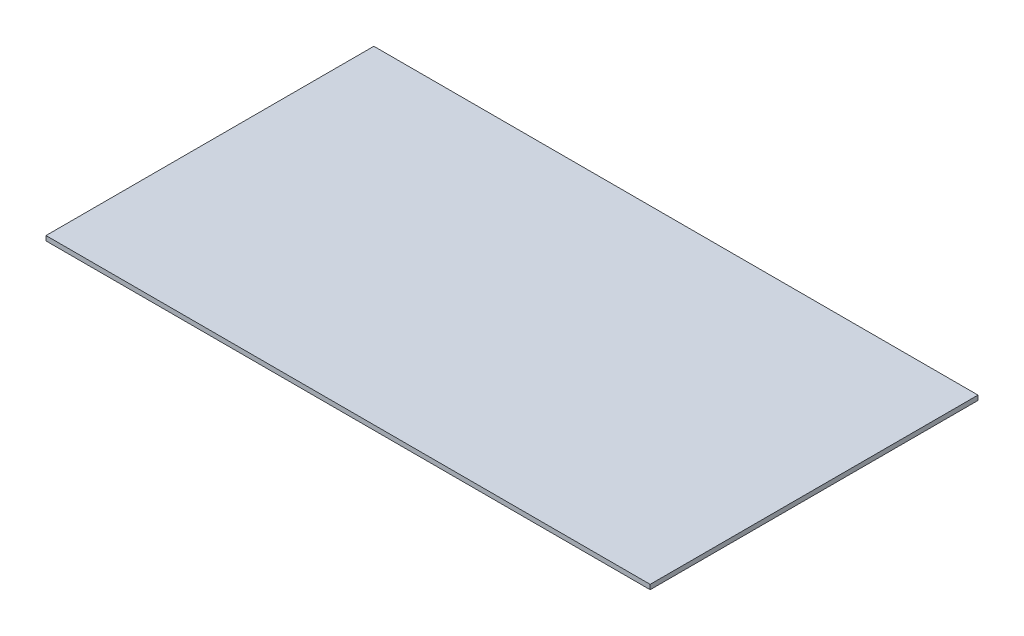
ISO-10303-21;
HEADER;
FILE_DESCRIPTION(('STEP AP214'),'2;1');
FILE_NAME('part.step','',(''),(''),'','','');
FILE_SCHEMA(('AUTOMOTIVE_DESIGN { 1 0 10303 214 1 1 1 1 }'));
ENDSEC;
DATA;
#1=APPLICATION_CONTEXT('core data for automotive mechanical design processes');
#2=APPLICATION_PROTOCOL_DEFINITION('international standard','automotive_design',2000,#1);
#3=PRODUCT_CONTEXT('',#1,'mechanical');
#4=PRODUCT('Part','Part','',(#3));
#5=PRODUCT_RELATED_PRODUCT_CATEGORY('part','',(#4));
#6=PRODUCT_DEFINITION_FORMATION('','',#4);
#7=PRODUCT_DEFINITION_CONTEXT('part definition',#1,'design');
#8=PRODUCT_DEFINITION('design','',#6,#7);
#9=PRODUCT_DEFINITION_SHAPE('','',#8);
#10=(LENGTH_UNIT() NAMED_UNIT(*) SI_UNIT(.MILLI.,.METRE.));
#11=(NAMED_UNIT(*) PLANE_ANGLE_UNIT() SI_UNIT($,.RADIAN.));
#12=(NAMED_UNIT(*) SI_UNIT($,.STERADIAN.) SOLID_ANGLE_UNIT());
#13=UNCERTAINTY_MEASURE_WITH_UNIT(LENGTH_MEASURE(1.E-05),#10,'distance_accuracy_value','');
#14=(GEOMETRIC_REPRESENTATION_CONTEXT(3) GLOBAL_UNCERTAINTY_ASSIGNED_CONTEXT((#13)) GLOBAL_UNIT_ASSIGNED_CONTEXT((#10,
#11,#12)) REPRESENTATION_CONTEXT('',''));
#15=CARTESIAN_POINT('',(0.,0.,0.));
#16=DIRECTION('',(0.,0.,1.));
#17=DIRECTION('',(1.,0.,0.));
#18=AXIS2_PLACEMENT_3D('',#15,#16,#17);
#19=CARTESIAN_POINT('',(-322.5,-59.9999999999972,995.019379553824));
#20=DIRECTION('',(1.,0.,0.));
#21=DIRECTION('',(0.,0.,-1.));
#22=AXIS2_PLACEMENT_3D('',#19,#20,#21);
#23=PLANE('',#22);
#24=DIRECTION('',(0.,-1.,0.));
#25=VECTOR('',#24,1.);
#26=CARTESIAN_POINT('',(-322.5,-59.9999999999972,350.));
#27=LINE('',#26,#25);
#28=CARTESIAN_POINT('',(-322.5,-55.0000000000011,350.));
#29=VERTEX_POINT('',#28);
#30=CARTESIAN_POINT('',(-322.5,-60.0000000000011,350.));
#31=VERTEX_POINT('',#30);
#32=EDGE_CURVE('E96',#29,#31,#27,.T.);
#33=ORIENTED_EDGE('',*,*,#32,.F.);
#34=DIRECTION('',(0.,0.,-1.));
#35=VECTOR('',#34,1.);
#36=CARTESIAN_POINT('',(-322.5,-54.9999999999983,995.019379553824));
#37=LINE('',#36,#35);
#38=CARTESIAN_POINT('',(-322.5,-54.9999999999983,0.));
#39=VERTEX_POINT('',#38);
#40=EDGE_CURVE('E87',#29,#39,#37,.T.);
#41=ORIENTED_EDGE('',*,*,#40,.T.);
#42=DIRECTION('',(0.,-1.,0.));
#43=VECTOR('',#42,1.);
#44=CARTESIAN_POINT('',(-322.5,-59.9999999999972,0.));
#45=LINE('',#44,#43);
#46=CARTESIAN_POINT('',(-322.5,-59.9999999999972,0.));
#47=VERTEX_POINT('',#46);
#48=EDGE_CURVE('E78',#39,#47,#45,.T.);
#49=ORIENTED_EDGE('',*,*,#48,.T.);
#50=DIRECTION('',(0.,0.,-1.));
#51=VECTOR('',#50,1.);
#52=CARTESIAN_POINT('',(-322.5,-59.9999999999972,995.019379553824));
#53=LINE('',#52,#51);
#54=EDGE_CURVE('E69',#31,#47,#53,.T.);
#55=ORIENTED_EDGE('',*,*,#54,.F.);
#56=EDGE_LOOP('',(#33,#41,#49,#55));
#57=FACE_BOUND('',#56,.T.);
#58=ADVANCED_FACE('F28',(#57),#23,.F.);
#59=CARTESIAN_POINT('',(-322.5,-59.9999999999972,995.019379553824));
#60=DIRECTION('',(0.,1.,0.));
#61=DIRECTION('',(0.,0.,1.));
#62=AXIS2_PLACEMENT_3D('',#59,#60,#61);
#63=PLANE('',#62);
#64=DIRECTION('',(1.,0.,0.));
#65=VECTOR('',#64,1.);
#66=CARTESIAN_POINT('',(-322.5,-59.9999999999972,350.));
#67=LINE('',#66,#65);
#68=CARTESIAN_POINT('',(322.5,-60.0000000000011,350.));
#69=VERTEX_POINT('',#68);
#70=EDGE_CURVE('E75',#31,#69,#67,.T.);
#71=ORIENTED_EDGE('',*,*,#70,.F.);
#72=ORIENTED_EDGE('',*,*,#54,.T.);
#73=DIRECTION('',(1.,0.,0.));
#74=VECTOR('',#73,1.);
#75=CARTESIAN_POINT('',(-322.5,-59.9999999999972,0.));
#76=LINE('',#75,#74);
#77=CARTESIAN_POINT('',(322.5,-59.9999999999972,0.));
#78=VERTEX_POINT('',#77);
#79=EDGE_CURVE('E72',#47,#78,#76,.T.);
#80=ORIENTED_EDGE('',*,*,#79,.T.);
#81=DIRECTION('',(0.,0.,-1.));
#82=VECTOR('',#81,1.);
#83=CARTESIAN_POINT('',(322.5,-59.9999999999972,995.019379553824));
#84=LINE('',#83,#82);
#85=EDGE_CURVE('E63',#69,#78,#84,.T.);
#86=ORIENTED_EDGE('',*,*,#85,.F.);
#87=EDGE_LOOP('',(#71,#72,#80,#86));
#88=FACE_BOUND('',#87,.T.);
#89=ADVANCED_FACE('F71',(#88),#63,.F.);
#90=CARTESIAN_POINT('',(322.5,-59.9999999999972,995.019379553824));
#91=DIRECTION('',(-1.,0.,0.));
#92=DIRECTION('',(0.,0.,1.));
#93=AXIS2_PLACEMENT_3D('',#90,#91,#92);
#94=PLANE('',#93);
#95=DIRECTION('',(0.,1.,0.));
#96=VECTOR('',#95,1.);
#97=CARTESIAN_POINT('',(322.5,-59.9999999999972,350.));
#98=LINE('',#97,#96);
#99=CARTESIAN_POINT('',(322.5,-54.9999999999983,350.));
#100=VERTEX_POINT('',#99);
#101=EDGE_CURVE('E32',#69,#100,#98,.T.);
#102=ORIENTED_EDGE('',*,*,#101,.F.);
#103=ORIENTED_EDGE('',*,*,#85,.T.);
#104=DIRECTION('',(0.,1.,0.));
#105=VECTOR('',#104,1.);
#106=CARTESIAN_POINT('',(322.5,-59.9999999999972,0.));
#107=LINE('',#106,#105);
#108=CARTESIAN_POINT('',(322.5,-54.9999999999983,0.));
#109=VERTEX_POINT('',#108);
#110=EDGE_CURVE('E84',#78,#109,#107,.T.);
#111=ORIENTED_EDGE('',*,*,#110,.T.);
#112=DIRECTION('',(0.,0.,-1.));
#113=VECTOR('',#112,1.);
#114=CARTESIAN_POINT('',(322.5,-54.9999999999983,995.019379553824));
#115=LINE('',#114,#113);
#116=EDGE_CURVE('E94',#100,#109,#115,.T.);
#117=ORIENTED_EDGE('',*,*,#116,.F.);
#118=EDGE_LOOP('',(#102,#103,#111,#117));
#119=FACE_BOUND('',#118,.T.);
#120=ADVANCED_FACE('F101',(#119),#94,.F.);
#121=CARTESIAN_POINT('',(-322.5,-54.9999999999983,995.019379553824));
#122=DIRECTION('',(0.,-1.,0.));
#123=DIRECTION('',(0.,0.,-1.));
#124=AXIS2_PLACEMENT_3D('',#121,#122,#123);
#125=PLANE('',#124);
#126=DIRECTION('',(-1.,0.,0.));
#127=VECTOR('',#126,1.);
#128=CARTESIAN_POINT('',(-322.5,-54.9999999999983,350.));
#129=LINE('',#128,#127);
#130=EDGE_CURVE('E11',#100,#29,#129,.T.);
#131=ORIENTED_EDGE('',*,*,#130,.F.);
#132=ORIENTED_EDGE('',*,*,#116,.T.);
#133=DIRECTION('',(-1.,0.,0.));
#134=VECTOR('',#133,1.);
#135=CARTESIAN_POINT('',(-322.5,-54.9999999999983,0.));
#136=LINE('',#135,#134);
#137=EDGE_CURVE('E95',#109,#39,#136,.T.);
#138=ORIENTED_EDGE('',*,*,#137,.T.);
#139=ORIENTED_EDGE('',*,*,#40,.F.);
#140=EDGE_LOOP('',(#131,#132,#138,#139));
#141=FACE_BOUND('',#140,.T.);
#142=ADVANCED_FACE('F102',(#141),#125,.F.);
#143=CARTESIAN_POINT('',(-322.5,-54.9999999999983,0.));
#144=DIRECTION('',(0.,0.,-1.));
#145=DIRECTION('',(-1.,0.,0.));
#146=AXIS2_PLACEMENT_3D('',#143,#144,#145);
#147=PLANE('',#146);
#148=ORIENTED_EDGE('',*,*,#48,.F.);
#149=ORIENTED_EDGE('',*,*,#137,.F.);
#150=ORIENTED_EDGE('',*,*,#110,.F.);
#151=ORIENTED_EDGE('',*,*,#79,.F.);
#152=EDGE_LOOP('',(#148,#149,#150,#151));
#153=FACE_BOUND('',#152,.T.);
#154=ADVANCED_FACE('F82',(#153),#147,.T.);
#155=CARTESIAN_POINT('',(-332.5,-60.0000000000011,350.));
#156=DIRECTION('',(0.,0.,1.));
#157=DIRECTION('',(1.,0.,0.));
#158=AXIS2_PLACEMENT_3D('',#155,#156,#157);
#159=PLANE('',#158);
#160=ORIENTED_EDGE('',*,*,#32,.T.);
#161=ORIENTED_EDGE('',*,*,#70,.T.);
#162=ORIENTED_EDGE('',*,*,#101,.T.);
#163=ORIENTED_EDGE('',*,*,#130,.T.);
#164=EDGE_LOOP('',(#160,#161,#162,#163));
#165=FACE_BOUND('',#164,.T.);
#166=ADVANCED_FACE('F30',(#165),#159,.T.);
#167=CLOSED_SHELL('',(#58,#89,#120,#142,#154,#166));
#168=MANIFOLD_SOLID_BREP('B2',#167);
#169=ADVANCED_BREP_SHAPE_REPRESENTATION('',(#18,#168),#14);
#170=SHAPE_DEFINITION_REPRESENTATION(#9,#169);
ENDSEC;
END-ISO-10303-21;
